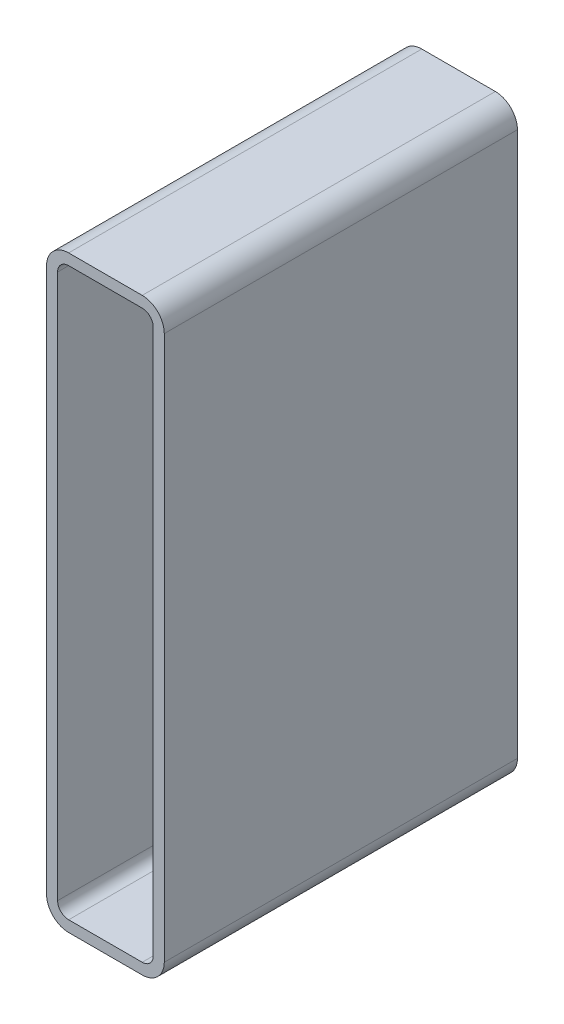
ISO-10303-21;
HEADER;
FILE_DESCRIPTION(('STEP AP214'),'2;1');
FILE_NAME('part.step','',(''),(''),'','','');
FILE_SCHEMA(('AUTOMOTIVE_DESIGN { 1 0 10303 214 1 1 1 1 }'));
ENDSEC;
DATA;
#1=APPLICATION_CONTEXT('core data for automotive mechanical design processes');
#2=APPLICATION_PROTOCOL_DEFINITION('international standard','automotive_design',2000,#1);
#3=PRODUCT_CONTEXT('',#1,'mechanical');
#4=PRODUCT('Part','Part','',(#3));
#5=PRODUCT_RELATED_PRODUCT_CATEGORY('part','',(#4));
#6=PRODUCT_DEFINITION_FORMATION('','',#4);
#7=PRODUCT_DEFINITION_CONTEXT('part definition',#1,'design');
#8=PRODUCT_DEFINITION('design','',#6,#7);
#9=PRODUCT_DEFINITION_SHAPE('','',#8);
#10=(LENGTH_UNIT() NAMED_UNIT(*) SI_UNIT(.MILLI.,.METRE.));
#11=(NAMED_UNIT(*) PLANE_ANGLE_UNIT() SI_UNIT($,.RADIAN.));
#12=(NAMED_UNIT(*) SI_UNIT($,.STERADIAN.) SOLID_ANGLE_UNIT());
#13=UNCERTAINTY_MEASURE_WITH_UNIT(LENGTH_MEASURE(1.E-05),#10,'distance_accuracy_value','');
#14=(GEOMETRIC_REPRESENTATION_CONTEXT(3) GLOBAL_UNCERTAINTY_ASSIGNED_CONTEXT((#13)) GLOBAL_UNIT_ASSIGNED_CONTEXT((#10,
#11,#12)) REPRESENTATION_CONTEXT('',''));
#15=CARTESIAN_POINT('',(0.,0.,0.));
#16=DIRECTION('',(0.,0.,1.));
#17=DIRECTION('',(1.,0.,0.));
#18=AXIS2_PLACEMENT_3D('',#15,#16,#17);
#19=CARTESIAN_POINT('',(84.2251778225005,20.741228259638,304.8));
#20=DIRECTION('',(0.,0.,1.));
#21=DIRECTION('',(1.,0.,0.));
#22=AXIS2_PLACEMENT_3D('',#19,#20,#21);
#23=PLANE('',#22);
#24=CARTESIAN_POINT('',(84.2251778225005,20.741228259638,304.8));
#25=DIRECTION('',(0.,0.,1.));
#26=DIRECTION('',(1.,0.,0.));
#27=AXIS2_PLACEMENT_3D('',#24,#25,#26);
#28=CIRCLE('',#27,19.05);
#29=CARTESIAN_POINT('',(84.2251778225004,1.69122825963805,304.8));
#30=VERTEX_POINT('',#29);
#31=CARTESIAN_POINT('',(103.2751778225,20.741228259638,304.8));
#32=VERTEX_POINT('',#31);
#33=EDGE_CURVE('E211',#30,#32,#28,.T.);
#34=ORIENTED_EDGE('',*,*,#33,.T.);
#35=DIRECTION('',(0.,1.,0.));
#36=VECTOR('',#35,1.);
#37=CARTESIAN_POINT('',(103.2751778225,20.741228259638,304.8));
#38=LINE('',#37,#36);
#39=CARTESIAN_POINT('',(103.2751778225,490.641228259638,304.8));
#40=VERTEX_POINT('',#39);
#41=EDGE_CURVE('E214',#32,#40,#38,.T.);
#42=ORIENTED_EDGE('',*,*,#41,.T.);
#43=CARTESIAN_POINT('',(84.2251778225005,490.641228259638,304.8));
#44=DIRECTION('',(0.,0.,1.));
#45=DIRECTION('',(1.,0.,0.));
#46=AXIS2_PLACEMENT_3D('',#43,#44,#45);
#47=CIRCLE('',#46,19.0499999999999);
#48=CARTESIAN_POINT('',(84.2251778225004,509.691228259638,304.8));
#49=VERTEX_POINT('',#48);
#50=EDGE_CURVE('E217',#40,#49,#47,.T.);
#51=ORIENTED_EDGE('',*,*,#50,.T.);
#52=DIRECTION('',(-1.,0.,0.));
#53=VECTOR('',#52,1.);
#54=CARTESIAN_POINT('',(84.2251778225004,509.691228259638,304.8));
#55=LINE('',#54,#53);
#56=CARTESIAN_POINT('',(20.7251778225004,509.691228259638,304.8));
#57=VERTEX_POINT('',#56);
#58=EDGE_CURVE('E219',#49,#57,#55,.T.);
#59=ORIENTED_EDGE('',*,*,#58,.T.);
#60=CARTESIAN_POINT('',(20.7251778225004,490.641228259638,304.8));
#61=DIRECTION('',(0.,0.,1.));
#62=DIRECTION('',(1.,0.,0.));
#63=AXIS2_PLACEMENT_3D('',#60,#61,#62);
#64=CIRCLE('',#63,19.0499999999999);
#65=CARTESIAN_POINT('',(1.67517782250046,490.641228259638,304.8));
#66=VERTEX_POINT('',#65);
#67=EDGE_CURVE('E221',#57,#66,#64,.T.);
#68=ORIENTED_EDGE('',*,*,#67,.T.);
#69=DIRECTION('',(0.,-1.,0.));
#70=VECTOR('',#69,1.);
#71=CARTESIAN_POINT('',(1.67517782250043,490.641228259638,304.8));
#72=LINE('',#71,#70);
#73=CARTESIAN_POINT('',(1.67517782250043,20.741228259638,304.8));
#74=VERTEX_POINT('',#73);
#75=EDGE_CURVE('E223',#66,#74,#72,.T.);
#76=ORIENTED_EDGE('',*,*,#75,.T.);
#77=CARTESIAN_POINT('',(20.7251778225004,20.741228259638,304.8));
#78=DIRECTION('',(0.,0.,1.));
#79=DIRECTION('',(1.,0.,0.));
#80=AXIS2_PLACEMENT_3D('',#77,#78,#79);
#81=CIRCLE('',#80,19.05);
#82=CARTESIAN_POINT('',(20.7251778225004,1.69122825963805,304.8));
#83=VERTEX_POINT('',#82);
#84=EDGE_CURVE('E225',#74,#83,#81,.T.);
#85=ORIENTED_EDGE('',*,*,#84,.T.);
#86=DIRECTION('',(1.,0.,0.));
#87=VECTOR('',#86,1.);
#88=CARTESIAN_POINT('',(20.7251778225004,1.69122825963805,304.8));
#89=LINE('',#88,#87);
#90=EDGE_CURVE('E227',#83,#30,#89,.T.);
#91=ORIENTED_EDGE('',*,*,#90,.T.);
#92=EDGE_LOOP('',(#34,#42,#51,#59,#68,#76,#85,#91));
#93=FACE_BOUND('',#92,.T.);
#94=DIRECTION('',(0.,-1.,0.));
#95=VECTOR('',#94,1.);
#96=CARTESIAN_POINT('',(11.2001778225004,20.741228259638,304.8));
#97=LINE('',#96,#95);
#98=CARTESIAN_POINT('',(11.2001778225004,490.641228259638,304.8));
#99=VERTEX_POINT('',#98);
#100=CARTESIAN_POINT('',(11.2001778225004,20.741228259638,304.8));
#101=VERTEX_POINT('',#100);
#102=EDGE_CURVE('E154',#99,#101,#97,.T.);
#103=ORIENTED_EDGE('',*,*,#102,.F.);
#104=CARTESIAN_POINT('',(20.7251778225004,490.641228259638,304.8));
#105=DIRECTION('',(0.,0.,1.));
#106=DIRECTION('',(1.,0.,0.));
#107=AXIS2_PLACEMENT_3D('',#104,#105,#106);
#108=CIRCLE('',#107,9.52499999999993);
#109=CARTESIAN_POINT('',(20.7251778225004,500.166228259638,304.8));
#110=VERTEX_POINT('',#109);
#111=EDGE_CURVE('E146',#110,#99,#108,.T.);
#112=ORIENTED_EDGE('',*,*,#111,.F.);
#113=DIRECTION('',(-1.,0.,0.));
#114=VECTOR('',#113,1.);
#115=CARTESIAN_POINT('',(20.7251778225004,500.166228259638,304.8));
#116=LINE('',#115,#114);
#117=CARTESIAN_POINT('',(84.2251778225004,500.166228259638,304.8));
#118=VERTEX_POINT('',#117);
#119=EDGE_CURVE('E179',#118,#110,#116,.T.);
#120=ORIENTED_EDGE('',*,*,#119,.F.);
#121=CARTESIAN_POINT('',(84.2251778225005,490.641228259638,304.8));
#122=DIRECTION('',(0.,0.,1.));
#123=DIRECTION('',(1.,0.,0.));
#124=AXIS2_PLACEMENT_3D('',#121,#122,#123);
#125=CIRCLE('',#124,9.52499999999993);
#126=CARTESIAN_POINT('',(93.7501778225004,490.641228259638,304.8));
#127=VERTEX_POINT('',#126);
#128=EDGE_CURVE('E177',#127,#118,#125,.T.);
#129=ORIENTED_EDGE('',*,*,#128,.F.);
#130=DIRECTION('',(0.,1.,0.));
#131=VECTOR('',#130,1.);
#132=CARTESIAN_POINT('',(93.7501778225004,490.641228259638,304.8));
#133=LINE('',#132,#131);
#134=CARTESIAN_POINT('',(93.7501778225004,20.741228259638,304.8));
#135=VERTEX_POINT('',#134);
#136=EDGE_CURVE('E175',#135,#127,#133,.T.);
#137=ORIENTED_EDGE('',*,*,#136,.F.);
#138=CARTESIAN_POINT('',(84.2251778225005,20.741228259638,304.8));
#139=DIRECTION('',(0.,0.,1.));
#140=DIRECTION('',(1.,0.,0.));
#141=AXIS2_PLACEMENT_3D('',#138,#139,#140);
#142=CIRCLE('',#141,9.52499999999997);
#143=CARTESIAN_POINT('',(84.2251778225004,11.2162282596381,304.8));
#144=VERTEX_POINT('',#143);
#145=EDGE_CURVE('E173',#144,#135,#142,.T.);
#146=ORIENTED_EDGE('',*,*,#145,.F.);
#147=DIRECTION('',(1.,0.,0.));
#148=VECTOR('',#147,1.);
#149=CARTESIAN_POINT('',(84.2251778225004,11.216228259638,304.8));
#150=LINE('',#149,#148);
#151=CARTESIAN_POINT('',(20.7251778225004,11.216228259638,304.8));
#152=VERTEX_POINT('',#151);
#153=EDGE_CURVE('E169',#152,#144,#150,.T.);
#154=ORIENTED_EDGE('',*,*,#153,.F.);
#155=CARTESIAN_POINT('',(20.7251778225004,20.741228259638,304.8));
#156=DIRECTION('',(0.,0.,1.));
#157=DIRECTION('',(1.,0.,0.));
#158=AXIS2_PLACEMENT_3D('',#155,#156,#157);
#159=CIRCLE('',#158,9.52499999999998);
#160=EDGE_CURVE('E167',#101,#152,#159,.T.);
#161=ORIENTED_EDGE('',*,*,#160,.F.);
#162=EDGE_LOOP('',(#103,#112,#120,#129,#137,#146,#154,#161));
#163=FACE_BOUND('',#162,.T.);
#164=ADVANCED_FACE('F33',(#93,#163),#23,.T.);
#165=CARTESIAN_POINT('',(84.2251778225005,20.741228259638,0.));
#166=DIRECTION('',(0.,0.,1.));
#167=DIRECTION('',(1.,0.,0.));
#168=AXIS2_PLACEMENT_3D('',#165,#166,#167);
#169=PLANE('',#168);
#170=CARTESIAN_POINT('',(84.2251778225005,20.741228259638,0.));
#171=DIRECTION('',(0.,0.,1.));
#172=DIRECTION('',(1.,0.,0.));
#173=AXIS2_PLACEMENT_3D('',#170,#171,#172);
#174=CIRCLE('',#173,19.05);
#175=CARTESIAN_POINT('',(84.2251778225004,1.69122825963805,0.));
#176=VERTEX_POINT('',#175);
#177=CARTESIAN_POINT('',(103.2751778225,20.741228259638,0.));
#178=VERTEX_POINT('',#177);
#179=EDGE_CURVE('E162',#176,#178,#174,.T.);
#180=ORIENTED_EDGE('',*,*,#179,.F.);
#181=DIRECTION('',(1.,0.,0.));
#182=VECTOR('',#181,1.);
#183=CARTESIAN_POINT('',(20.7251778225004,1.69122825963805,0.));
#184=LINE('',#183,#182);
#185=CARTESIAN_POINT('',(20.7251778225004,1.69122825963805,0.));
#186=VERTEX_POINT('',#185);
#187=EDGE_CURVE('E215',#186,#176,#184,.T.);
#188=ORIENTED_EDGE('',*,*,#187,.F.);
#189=CARTESIAN_POINT('',(20.7251778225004,20.741228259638,0.));
#190=DIRECTION('',(0.,0.,1.));
#191=DIRECTION('',(1.,0.,0.));
#192=AXIS2_PLACEMENT_3D('',#189,#190,#191);
#193=CIRCLE('',#192,19.05);
#194=CARTESIAN_POINT('',(1.67517782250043,20.741228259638,0.));
#195=VERTEX_POINT('',#194);
#196=EDGE_CURVE('E242',#195,#186,#193,.T.);
#197=ORIENTED_EDGE('',*,*,#196,.F.);
#198=DIRECTION('',(0.,-1.,0.));
#199=VECTOR('',#198,1.);
#200=CARTESIAN_POINT('',(1.67517782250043,490.641228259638,0.));
#201=LINE('',#200,#199);
#202=CARTESIAN_POINT('',(1.67517782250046,490.641228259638,0.));
#203=VERTEX_POINT('',#202);
#204=EDGE_CURVE('E240',#203,#195,#201,.T.);
#205=ORIENTED_EDGE('',*,*,#204,.F.);
#206=CARTESIAN_POINT('',(20.7251778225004,490.641228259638,0.));
#207=DIRECTION('',(0.,0.,1.));
#208=DIRECTION('',(1.,0.,0.));
#209=AXIS2_PLACEMENT_3D('',#206,#207,#208);
#210=CIRCLE('',#209,19.0499999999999);
#211=CARTESIAN_POINT('',(20.7251778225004,509.691228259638,0.));
#212=VERTEX_POINT('',#211);
#213=EDGE_CURVE('E238',#212,#203,#210,.T.);
#214=ORIENTED_EDGE('',*,*,#213,.F.);
#215=DIRECTION('',(-1.,0.,0.));
#216=VECTOR('',#215,1.);
#217=CARTESIAN_POINT('',(84.2251778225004,509.691228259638,0.));
#218=LINE('',#217,#216);
#219=CARTESIAN_POINT('',(84.2251778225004,509.691228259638,0.));
#220=VERTEX_POINT('',#219);
#221=EDGE_CURVE('E236',#220,#212,#218,.T.);
#222=ORIENTED_EDGE('',*,*,#221,.F.);
#223=CARTESIAN_POINT('',(84.2251778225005,490.641228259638,0.));
#224=DIRECTION('',(0.,0.,1.));
#225=DIRECTION('',(1.,0.,0.));
#226=AXIS2_PLACEMENT_3D('',#223,#224,#225);
#227=CIRCLE('',#226,19.0499999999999);
#228=CARTESIAN_POINT('',(103.2751778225,490.641228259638,0.));
#229=VERTEX_POINT('',#228);
#230=EDGE_CURVE('E234',#229,#220,#227,.T.);
#231=ORIENTED_EDGE('',*,*,#230,.F.);
#232=DIRECTION('',(0.,1.,0.));
#233=VECTOR('',#232,1.);
#234=CARTESIAN_POINT('',(103.2751778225,20.741228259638,0.));
#235=LINE('',#234,#233);
#236=EDGE_CURVE('E232',#178,#229,#235,.T.);
#237=ORIENTED_EDGE('',*,*,#236,.F.);
#238=EDGE_LOOP('',(#180,#188,#197,#205,#214,#222,#231,#237));
#239=FACE_BOUND('',#238,.T.);
#240=CARTESIAN_POINT('',(20.7251778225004,490.641228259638,0.));
#241=DIRECTION('',(0.,0.,1.));
#242=DIRECTION('',(1.,0.,0.));
#243=AXIS2_PLACEMENT_3D('',#240,#241,#242);
#244=CIRCLE('',#243,9.52499999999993);
#245=CARTESIAN_POINT('',(20.7251778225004,500.166228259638,0.));
#246=VERTEX_POINT('',#245);
#247=CARTESIAN_POINT('',(11.2001778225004,490.641228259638,0.));
#248=VERTEX_POINT('',#247);
#249=EDGE_CURVE('E56',#246,#248,#244,.T.);
#250=ORIENTED_EDGE('',*,*,#249,.T.);
#251=DIRECTION('',(0.,-1.,0.));
#252=VECTOR('',#251,1.);
#253=CARTESIAN_POINT('',(11.2001778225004,20.741228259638,0.));
#254=LINE('',#253,#252);
#255=CARTESIAN_POINT('',(11.2001778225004,20.741228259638,0.));
#256=VERTEX_POINT('',#255);
#257=EDGE_CURVE('E161',#248,#256,#254,.T.);
#258=ORIENTED_EDGE('',*,*,#257,.T.);
#259=CARTESIAN_POINT('',(20.7251778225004,20.741228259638,0.));
#260=DIRECTION('',(0.,0.,1.));
#261=DIRECTION('',(1.,0.,0.));
#262=AXIS2_PLACEMENT_3D('',#259,#260,#261);
#263=CIRCLE('',#262,9.52499999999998);
#264=CARTESIAN_POINT('',(20.7251778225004,11.216228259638,0.));
#265=VERTEX_POINT('',#264);
#266=EDGE_CURVE('E183',#256,#265,#263,.T.);
#267=ORIENTED_EDGE('',*,*,#266,.T.);
#268=DIRECTION('',(1.,0.,0.));
#269=VECTOR('',#268,1.);
#270=CARTESIAN_POINT('',(84.2251778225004,11.216228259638,0.));
#271=LINE('',#270,#269);
#272=CARTESIAN_POINT('',(84.2251778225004,11.2162282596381,0.));
#273=VERTEX_POINT('',#272);
#274=EDGE_CURVE('E186',#265,#273,#271,.T.);
#275=ORIENTED_EDGE('',*,*,#274,.T.);
#276=CARTESIAN_POINT('',(84.2251778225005,20.741228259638,0.));
#277=DIRECTION('',(0.,0.,1.));
#278=DIRECTION('',(1.,0.,0.));
#279=AXIS2_PLACEMENT_3D('',#276,#277,#278);
#280=CIRCLE('',#279,9.52499999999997);
#281=CARTESIAN_POINT('',(93.7501778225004,20.741228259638,0.));
#282=VERTEX_POINT('',#281);
#283=EDGE_CURVE('E189',#273,#282,#280,.T.);
#284=ORIENTED_EDGE('',*,*,#283,.T.);
#285=DIRECTION('',(0.,1.,0.));
#286=VECTOR('',#285,1.);
#287=CARTESIAN_POINT('',(93.7501778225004,490.641228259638,0.));
#288=LINE('',#287,#286);
#289=CARTESIAN_POINT('',(93.7501778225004,490.641228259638,0.));
#290=VERTEX_POINT('',#289);
#291=EDGE_CURVE('E192',#282,#290,#288,.T.);
#292=ORIENTED_EDGE('',*,*,#291,.T.);
#293=CARTESIAN_POINT('',(84.2251778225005,490.641228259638,0.));
#294=DIRECTION('',(0.,0.,1.));
#295=DIRECTION('',(1.,0.,0.));
#296=AXIS2_PLACEMENT_3D('',#293,#294,#295);
#297=CIRCLE('',#296,9.52499999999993);
#298=CARTESIAN_POINT('',(84.2251778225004,500.166228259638,0.));
#299=VERTEX_POINT('',#298);
#300=EDGE_CURVE('E195',#290,#299,#297,.T.);
#301=ORIENTED_EDGE('',*,*,#300,.T.);
#302=DIRECTION('',(-1.,0.,0.));
#303=VECTOR('',#302,1.);
#304=CARTESIAN_POINT('',(20.7251778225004,500.166228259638,0.));
#305=LINE('',#304,#303);
#306=EDGE_CURVE('E155',#299,#246,#305,.T.);
#307=ORIENTED_EDGE('',*,*,#306,.T.);
#308=EDGE_LOOP('',(#250,#258,#267,#275,#284,#292,#301,#307));
#309=FACE_BOUND('',#308,.T.);
#310=ADVANCED_FACE('F272',(#239,#309),#169,.F.);
#311=CARTESIAN_POINT('',(84.2251778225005,20.741228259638,304.8));
#312=DIRECTION('',(0.,0.,-1.));
#313=DIRECTION('',(-1.,0.,0.));
#314=AXIS2_PLACEMENT_3D('',#311,#312,#313);
#315=CYLINDRICAL_SURFACE('',#314,19.05);
#316=ORIENTED_EDGE('',*,*,#179,.T.);
#317=DIRECTION('',(0.,0.,-1.));
#318=VECTOR('',#317,1.);
#319=CARTESIAN_POINT('',(103.2751778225,20.741228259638,304.8));
#320=LINE('',#319,#318);
#321=EDGE_CURVE('E11',#32,#178,#320,.T.);
#322=ORIENTED_EDGE('',*,*,#321,.F.);
#323=ORIENTED_EDGE('',*,*,#33,.F.);
#324=DIRECTION('',(0.,0.,-1.));
#325=VECTOR('',#324,1.);
#326=CARTESIAN_POINT('',(84.2251778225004,1.69122825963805,304.8));
#327=LINE('',#326,#325);
#328=EDGE_CURVE('E229',#30,#176,#327,.T.);
#329=ORIENTED_EDGE('',*,*,#328,.T.);
#330=EDGE_LOOP('',(#316,#322,#323,#329));
#331=FACE_BOUND('',#330,.T.);
#332=ADVANCED_FACE('F35',(#331),#315,.T.);
#333=CARTESIAN_POINT('',(103.2751778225,20.741228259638,304.8));
#334=DIRECTION('',(-1.,0.,0.));
#335=DIRECTION('',(0.,0.,1.));
#336=AXIS2_PLACEMENT_3D('',#333,#334,#335);
#337=PLANE('',#336);
#338=ORIENTED_EDGE('',*,*,#236,.T.);
#339=DIRECTION('',(0.,0.,-1.));
#340=VECTOR('',#339,1.);
#341=CARTESIAN_POINT('',(103.2751778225,490.641228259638,304.8));
#342=LINE('',#341,#340);
#343=EDGE_CURVE('E41',#40,#229,#342,.T.);
#344=ORIENTED_EDGE('',*,*,#343,.F.);
#345=ORIENTED_EDGE('',*,*,#41,.F.);
#346=ORIENTED_EDGE('',*,*,#321,.T.);
#347=EDGE_LOOP('',(#338,#344,#345,#346));
#348=FACE_BOUND('',#347,.T.);
#349=ADVANCED_FACE('F289',(#348),#337,.F.);
#350=CARTESIAN_POINT('',(84.2251778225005,490.641228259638,304.8));
#351=DIRECTION('',(0.,0.,-1.));
#352=DIRECTION('',(-1.,0.,0.));
#353=AXIS2_PLACEMENT_3D('',#350,#351,#352);
#354=CYLINDRICAL_SURFACE('',#353,19.0499999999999);
#355=ORIENTED_EDGE('',*,*,#230,.T.);
#356=DIRECTION('',(0.,0.,-1.));
#357=VECTOR('',#356,1.);
#358=CARTESIAN_POINT('',(84.2251778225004,509.691228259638,304.8));
#359=LINE('',#358,#357);
#360=EDGE_CURVE('E259',#49,#220,#359,.T.);
#361=ORIENTED_EDGE('',*,*,#360,.F.);
#362=ORIENTED_EDGE('',*,*,#50,.F.);
#363=ORIENTED_EDGE('',*,*,#343,.T.);
#364=EDGE_LOOP('',(#355,#361,#362,#363));
#365=FACE_BOUND('',#364,.T.);
#366=ADVANCED_FACE('F266',(#365),#354,.T.);
#367=CARTESIAN_POINT('',(84.2251778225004,509.691228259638,304.8));
#368=DIRECTION('',(0.,-1.,0.));
#369=DIRECTION('',(0.,0.,-1.));
#370=AXIS2_PLACEMENT_3D('',#367,#368,#369);
#371=PLANE('',#370);
#372=ORIENTED_EDGE('',*,*,#221,.T.);
#373=DIRECTION('',(0.,0.,-1.));
#374=VECTOR('',#373,1.);
#375=CARTESIAN_POINT('',(20.7251778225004,509.691228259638,304.8));
#376=LINE('',#375,#374);
#377=EDGE_CURVE('E256',#57,#212,#376,.T.);
#378=ORIENTED_EDGE('',*,*,#377,.F.);
#379=ORIENTED_EDGE('',*,*,#58,.F.);
#380=ORIENTED_EDGE('',*,*,#360,.T.);
#381=EDGE_LOOP('',(#372,#378,#379,#380));
#382=FACE_BOUND('',#381,.T.);
#383=ADVANCED_FACE('F278',(#382),#371,.F.);
#384=CARTESIAN_POINT('',(20.7251778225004,490.641228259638,304.8));
#385=DIRECTION('',(0.,0.,-1.));
#386=DIRECTION('',(-1.,0.,0.));
#387=AXIS2_PLACEMENT_3D('',#384,#385,#386);
#388=CYLINDRICAL_SURFACE('',#387,19.0499999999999);
#389=ORIENTED_EDGE('',*,*,#213,.T.);
#390=DIRECTION('',(0.,0.,-1.));
#391=VECTOR('',#390,1.);
#392=CARTESIAN_POINT('',(1.67517782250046,490.641228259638,304.8));
#393=LINE('',#392,#391);
#394=EDGE_CURVE('E253',#66,#203,#393,.T.);
#395=ORIENTED_EDGE('',*,*,#394,.F.);
#396=ORIENTED_EDGE('',*,*,#67,.F.);
#397=ORIENTED_EDGE('',*,*,#377,.T.);
#398=EDGE_LOOP('',(#389,#395,#396,#397));
#399=FACE_BOUND('',#398,.T.);
#400=ADVANCED_FACE('F282',(#399),#388,.T.);
#401=CARTESIAN_POINT('',(1.67517782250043,490.641228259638,304.8));
#402=DIRECTION('',(1.,0.,0.));
#403=DIRECTION('',(0.,0.,-1.));
#404=AXIS2_PLACEMENT_3D('',#401,#402,#403);
#405=PLANE('',#404);
#406=ORIENTED_EDGE('',*,*,#204,.T.);
#407=DIRECTION('',(0.,0.,-1.));
#408=VECTOR('',#407,1.);
#409=CARTESIAN_POINT('',(1.67517782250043,20.741228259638,304.8));
#410=LINE('',#409,#408);
#411=EDGE_CURVE('E250',#74,#195,#410,.T.);
#412=ORIENTED_EDGE('',*,*,#411,.F.);
#413=ORIENTED_EDGE('',*,*,#75,.F.);
#414=ORIENTED_EDGE('',*,*,#394,.T.);
#415=EDGE_LOOP('',(#406,#412,#413,#414));
#416=FACE_BOUND('',#415,.T.);
#417=ADVANCED_FACE('F302',(#416),#405,.F.);
#418=CARTESIAN_POINT('',(20.7251778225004,20.741228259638,304.8));
#419=DIRECTION('',(0.,0.,-1.));
#420=DIRECTION('',(-1.,0.,0.));
#421=AXIS2_PLACEMENT_3D('',#418,#419,#420);
#422=CYLINDRICAL_SURFACE('',#421,19.05);
#423=ORIENTED_EDGE('',*,*,#196,.T.);
#424=DIRECTION('',(0.,0.,-1.));
#425=VECTOR('',#424,1.);
#426=CARTESIAN_POINT('',(20.7251778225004,1.69122825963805,304.8));
#427=LINE('',#426,#425);
#428=EDGE_CURVE('E247',#83,#186,#427,.T.);
#429=ORIENTED_EDGE('',*,*,#428,.F.);
#430=ORIENTED_EDGE('',*,*,#84,.F.);
#431=ORIENTED_EDGE('',*,*,#411,.T.);
#432=EDGE_LOOP('',(#423,#429,#430,#431));
#433=FACE_BOUND('',#432,.T.);
#434=ADVANCED_FACE('F300',(#433),#422,.T.);
#435=CARTESIAN_POINT('',(20.7251778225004,1.69122825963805,304.8));
#436=DIRECTION('',(0.,1.,0.));
#437=DIRECTION('',(0.,0.,1.));
#438=AXIS2_PLACEMENT_3D('',#435,#436,#437);
#439=PLANE('',#438);
#440=ORIENTED_EDGE('',*,*,#187,.T.);
#441=ORIENTED_EDGE('',*,*,#328,.F.);
#442=ORIENTED_EDGE('',*,*,#90,.F.);
#443=ORIENTED_EDGE('',*,*,#428,.T.);
#444=EDGE_LOOP('',(#440,#441,#442,#443));
#445=FACE_BOUND('',#444,.T.);
#446=ADVANCED_FACE('F295',(#445),#439,.F.);
#447=CARTESIAN_POINT('',(20.7251778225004,490.641228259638,304.8));
#448=DIRECTION('',(0.,0.,-1.));
#449=DIRECTION('',(-1.,0.,0.));
#450=AXIS2_PLACEMENT_3D('',#447,#448,#449);
#451=CYLINDRICAL_SURFACE('',#450,9.52499999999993);
#452=ORIENTED_EDGE('',*,*,#249,.F.);
#453=DIRECTION('',(0.,0.,-1.));
#454=VECTOR('',#453,1.);
#455=CARTESIAN_POINT('',(20.7251778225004,500.166228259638,304.8));
#456=LINE('',#455,#454);
#457=EDGE_CURVE('E150',#110,#246,#456,.T.);
#458=ORIENTED_EDGE('',*,*,#457,.F.);
#459=ORIENTED_EDGE('',*,*,#111,.T.);
#460=DIRECTION('',(0.,0.,-1.));
#461=VECTOR('',#460,1.);
#462=CARTESIAN_POINT('',(11.2001778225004,490.641228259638,304.8));
#463=LINE('',#462,#461);
#464=EDGE_CURVE('E149',#99,#248,#463,.T.);
#465=ORIENTED_EDGE('',*,*,#464,.T.);
#466=EDGE_LOOP('',(#452,#458,#459,#465));
#467=FACE_BOUND('',#466,.T.);
#468=ADVANCED_FACE('F148',(#467),#451,.F.);
#469=CARTESIAN_POINT('',(11.2001778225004,20.741228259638,304.8));
#470=DIRECTION('',(1.,0.,0.));
#471=DIRECTION('',(0.,0.,-1.));
#472=AXIS2_PLACEMENT_3D('',#469,#470,#471);
#473=PLANE('',#472);
#474=ORIENTED_EDGE('',*,*,#257,.F.);
#475=ORIENTED_EDGE('',*,*,#464,.F.);
#476=ORIENTED_EDGE('',*,*,#102,.T.);
#477=DIRECTION('',(0.,0.,-1.));
#478=VECTOR('',#477,1.);
#479=CARTESIAN_POINT('',(11.2001778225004,20.741228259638,304.8));
#480=LINE('',#479,#478);
#481=EDGE_CURVE('E163',#101,#256,#480,.T.);
#482=ORIENTED_EDGE('',*,*,#481,.T.);
#483=EDGE_LOOP('',(#474,#475,#476,#482));
#484=FACE_BOUND('',#483,.T.);
#485=ADVANCED_FACE('F158',(#484),#473,.T.);
#486=CARTESIAN_POINT('',(20.7251778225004,20.741228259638,304.8));
#487=DIRECTION('',(0.,0.,-1.));
#488=DIRECTION('',(-1.,0.,0.));
#489=AXIS2_PLACEMENT_3D('',#486,#487,#488);
#490=CYLINDRICAL_SURFACE('',#489,9.52499999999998);
#491=ORIENTED_EDGE('',*,*,#266,.F.);
#492=ORIENTED_EDGE('',*,*,#481,.F.);
#493=ORIENTED_EDGE('',*,*,#160,.T.);
#494=DIRECTION('',(0.,0.,-1.));
#495=VECTOR('',#494,1.);
#496=CARTESIAN_POINT('',(20.7251778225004,11.216228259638,304.8));
#497=LINE('',#496,#495);
#498=EDGE_CURVE('E208',#152,#265,#497,.T.);
#499=ORIENTED_EDGE('',*,*,#498,.T.);
#500=EDGE_LOOP('',(#491,#492,#493,#499));
#501=FACE_BOUND('',#500,.T.);
#502=ADVANCED_FACE('F327',(#501),#490,.F.);
#503=CARTESIAN_POINT('',(84.2251778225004,11.216228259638,304.8));
#504=DIRECTION('',(0.,1.,0.));
#505=DIRECTION('',(0.,0.,1.));
#506=AXIS2_PLACEMENT_3D('',#503,#504,#505);
#507=PLANE('',#506);
#508=ORIENTED_EDGE('',*,*,#274,.F.);
#509=ORIENTED_EDGE('',*,*,#498,.F.);
#510=ORIENTED_EDGE('',*,*,#153,.T.);
#511=DIRECTION('',(0.,0.,-1.));
#512=VECTOR('',#511,1.);
#513=CARTESIAN_POINT('',(84.2251778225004,11.2162282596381,304.8));
#514=LINE('',#513,#512);
#515=EDGE_CURVE('E206',#144,#273,#514,.T.);
#516=ORIENTED_EDGE('',*,*,#515,.T.);
#517=EDGE_LOOP('',(#508,#509,#510,#516));
#518=FACE_BOUND('',#517,.T.);
#519=ADVANCED_FACE('F331',(#518),#507,.T.);
#520=CARTESIAN_POINT('',(84.2251778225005,20.741228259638,304.8));
#521=DIRECTION('',(0.,0.,-1.));
#522=DIRECTION('',(-1.,0.,0.));
#523=AXIS2_PLACEMENT_3D('',#520,#521,#522);
#524=CYLINDRICAL_SURFACE('',#523,9.52499999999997);
#525=ORIENTED_EDGE('',*,*,#283,.F.);
#526=ORIENTED_EDGE('',*,*,#515,.F.);
#527=ORIENTED_EDGE('',*,*,#145,.T.);
#528=DIRECTION('',(0.,0.,-1.));
#529=VECTOR('',#528,1.);
#530=CARTESIAN_POINT('',(93.7501778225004,20.741228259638,304.8));
#531=LINE('',#530,#529);
#532=EDGE_CURVE('E204',#135,#282,#531,.T.);
#533=ORIENTED_EDGE('',*,*,#532,.T.);
#534=EDGE_LOOP('',(#525,#526,#527,#533));
#535=FACE_BOUND('',#534,.T.);
#536=ADVANCED_FACE('F337',(#535),#524,.F.);
#537=CARTESIAN_POINT('',(93.7501778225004,490.641228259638,304.8));
#538=DIRECTION('',(-1.,0.,0.));
#539=DIRECTION('',(0.,0.,1.));
#540=AXIS2_PLACEMENT_3D('',#537,#538,#539);
#541=PLANE('',#540);
#542=ORIENTED_EDGE('',*,*,#291,.F.);
#543=ORIENTED_EDGE('',*,*,#532,.F.);
#544=ORIENTED_EDGE('',*,*,#136,.T.);
#545=DIRECTION('',(0.,0.,-1.));
#546=VECTOR('',#545,1.);
#547=CARTESIAN_POINT('',(93.7501778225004,490.641228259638,304.8));
#548=LINE('',#547,#546);
#549=EDGE_CURVE('E202',#127,#290,#548,.T.);
#550=ORIENTED_EDGE('',*,*,#549,.T.);
#551=EDGE_LOOP('',(#542,#543,#544,#550));
#552=FACE_BOUND('',#551,.T.);
#553=ADVANCED_FACE('F341',(#552),#541,.T.);
#554=CARTESIAN_POINT('',(84.2251778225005,490.641228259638,304.8));
#555=DIRECTION('',(0.,0.,-1.));
#556=DIRECTION('',(-1.,0.,0.));
#557=AXIS2_PLACEMENT_3D('',#554,#555,#556);
#558=CYLINDRICAL_SURFACE('',#557,9.52499999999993);
#559=ORIENTED_EDGE('',*,*,#300,.F.);
#560=ORIENTED_EDGE('',*,*,#549,.F.);
#561=ORIENTED_EDGE('',*,*,#128,.T.);
#562=DIRECTION('',(0.,0.,-1.));
#563=VECTOR('',#562,1.);
#564=CARTESIAN_POINT('',(84.2251778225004,500.166228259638,304.8));
#565=LINE('',#564,#563);
#566=EDGE_CURVE('E48',#118,#299,#565,.T.);
#567=ORIENTED_EDGE('',*,*,#566,.T.);
#568=EDGE_LOOP('',(#559,#560,#561,#567));
#569=FACE_BOUND('',#568,.T.);
#570=ADVANCED_FACE('F345',(#569),#558,.F.);
#571=CARTESIAN_POINT('',(20.7251778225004,500.166228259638,304.8));
#572=DIRECTION('',(0.,-1.,0.));
#573=DIRECTION('',(0.,0.,-1.));
#574=AXIS2_PLACEMENT_3D('',#571,#572,#573);
#575=PLANE('',#574);
#576=ORIENTED_EDGE('',*,*,#306,.F.);
#577=ORIENTED_EDGE('',*,*,#566,.F.);
#578=ORIENTED_EDGE('',*,*,#119,.T.);
#579=ORIENTED_EDGE('',*,*,#457,.T.);
#580=EDGE_LOOP('',(#576,#577,#578,#579));
#581=FACE_BOUND('',#580,.T.);
#582=ADVANCED_FACE('F349',(#581),#575,.T.);
#583=CLOSED_SHELL('',(#164,#310,#332,#349,#366,#383,#400,#417,#434,#446,#468,#485,#502,#519,
#536,#553,#570,#582));
#584=MANIFOLD_SOLID_BREP('B2',#583);
#585=ADVANCED_BREP_SHAPE_REPRESENTATION('',(#18,#584),#14);
#586=SHAPE_DEFINITION_REPRESENTATION(#9,#585);
ENDSEC;
END-ISO-10303-21;
